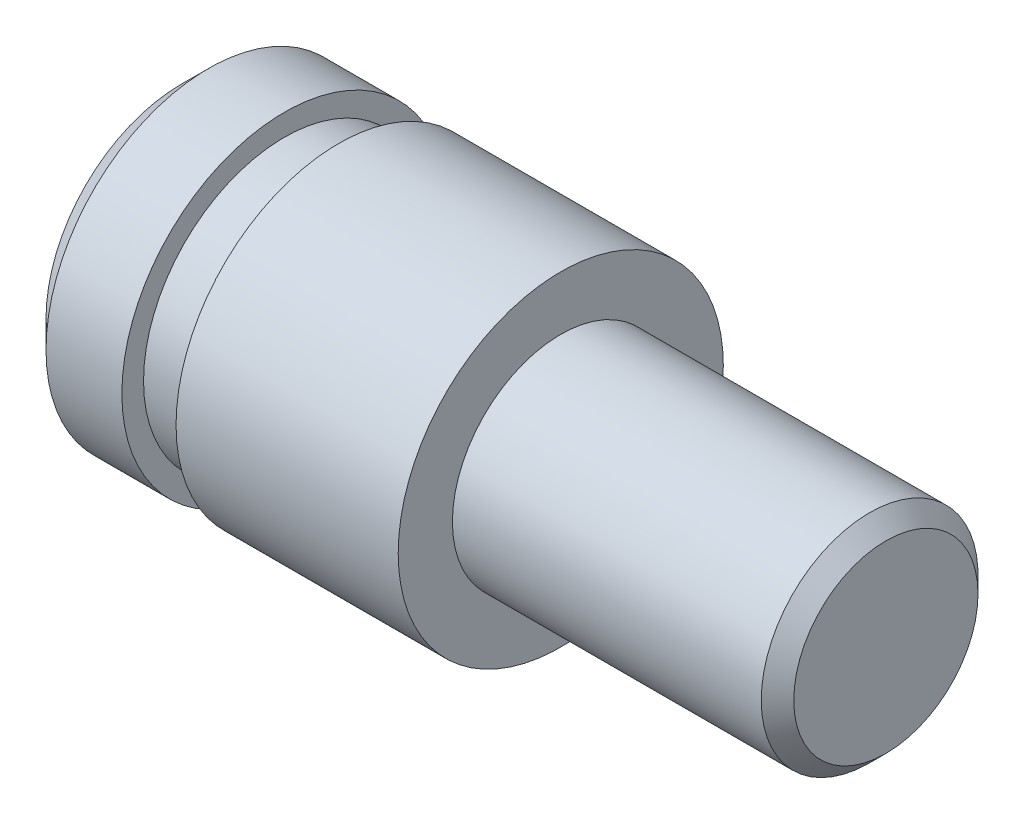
ISO-10303-21;
HEADER;
FILE_DESCRIPTION(('STEP AP214'),'2;1');
FILE_NAME('part.step','',(''),(''),'','','');
FILE_SCHEMA(('AUTOMOTIVE_DESIGN { 1 0 10303 214 1 1 1 1 }'));
ENDSEC;
DATA;
#1=APPLICATION_CONTEXT('core data for automotive mechanical design processes');
#2=APPLICATION_PROTOCOL_DEFINITION('international standard','automotive_design',2000,#1);
#3=PRODUCT_CONTEXT('',#1,'mechanical');
#4=PRODUCT('Part','Part','',(#3));
#5=PRODUCT_RELATED_PRODUCT_CATEGORY('part','',(#4));
#6=PRODUCT_DEFINITION_FORMATION('','',#4);
#7=PRODUCT_DEFINITION_CONTEXT('part definition',#1,'design');
#8=PRODUCT_DEFINITION('design','',#6,#7);
#9=PRODUCT_DEFINITION_SHAPE('','',#8);
#10=(LENGTH_UNIT() NAMED_UNIT(*) SI_UNIT(.MILLI.,.METRE.));
#11=(NAMED_UNIT(*) PLANE_ANGLE_UNIT() SI_UNIT($,.RADIAN.));
#12=(NAMED_UNIT(*) SI_UNIT($,.STERADIAN.) SOLID_ANGLE_UNIT());
#13=UNCERTAINTY_MEASURE_WITH_UNIT(LENGTH_MEASURE(1.E-05),#10,'distance_accuracy_value','');
#14=(GEOMETRIC_REPRESENTATION_CONTEXT(3) GLOBAL_UNCERTAINTY_ASSIGNED_CONTEXT((#13)) GLOBAL_UNIT_ASSIGNED_CONTEXT((#10,
#11,#12)) REPRESENTATION_CONTEXT('',''));
#15=CARTESIAN_POINT('',(0.,0.,0.));
#16=DIRECTION('',(0.,0.,1.));
#17=DIRECTION('',(1.,0.,0.));
#18=AXIS2_PLACEMENT_3D('',#15,#16,#17);
#19=CARTESIAN_POINT('',(0.,1.,0.));
#20=DIRECTION('',(-1.,0.,0.));
#21=DIRECTION('',(0.,0.,1.));
#22=AXIS2_PLACEMENT_3D('',#19,#20,#21);
#23=PLANE('',#22);
#24=CARTESIAN_POINT('',(0.,0.,0.));
#25=DIRECTION('',(-1.,0.,0.));
#26=DIRECTION('',(0.,0.,1.));
#27=AXIS2_PLACEMENT_3D('',#24,#25,#26);
#28=CIRCLE('',#27,1.5);
#29=CARTESIAN_POINT('',(0.,0.,1.5));
#30=VERTEX_POINT('',#29);
#31=EDGE_CURVE('E49',#30,#30,#28,.T.);
#32=ORIENTED_EDGE('',*,*,#31,.F.);
#33=EDGE_LOOP('',(#32));
#34=FACE_BOUND('',#33,.T.);
#35=CARTESIAN_POINT('',(0.,0.,0.));
#36=DIRECTION('',(-1.,0.,0.));
#37=DIRECTION('',(0.,0.,1.));
#38=AXIS2_PLACEMENT_3D('',#35,#36,#37);
#39=CIRCLE('',#38,1.);
#40=CARTESIAN_POINT('',(0.,0.,1.));
#41=VERTEX_POINT('',#40);
#42=EDGE_CURVE('E34',#41,#41,#39,.T.);
#43=ORIENTED_EDGE('',*,*,#42,.T.);
#44=EDGE_LOOP('',(#43));
#45=FACE_BOUND('',#44,.T.);
#46=ADVANCED_FACE('F15',(#34,#45),#23,.F.);
#47=CARTESIAN_POINT('',(0.,0.,0.));
#48=DIRECTION('',(-1.,0.,0.));
#49=DIRECTION('',(0.,0.,1.));
#50=AXIS2_PLACEMENT_3D('',#47,#48,#49);
#51=CYLINDRICAL_SURFACE('',#50,1.);
#52=CARTESIAN_POINT('',(2.85,0.,0.));
#53=DIRECTION('',(-1.,0.,0.));
#54=DIRECTION('',(0.,0.,1.));
#55=AXIS2_PLACEMENT_3D('',#52,#53,#54);
#56=CIRCLE('',#55,1.);
#57=CARTESIAN_POINT('',(2.85,0.,1.));
#58=VERTEX_POINT('',#57);
#59=EDGE_CURVE('E29',#58,#58,#56,.T.);
#60=ORIENTED_EDGE('',*,*,#59,.T.);
#61=EDGE_LOOP('',(#60));
#62=FACE_BOUND('',#61,.T.);
#63=ORIENTED_EDGE('',*,*,#42,.F.);
#64=EDGE_LOOP('',(#63));
#65=FACE_BOUND('',#64,.T.);
#66=ADVANCED_FACE('F57',(#62,#65),#51,.T.);
#67=CARTESIAN_POINT('',(3.,1.,0.));
#68=DIRECTION('',(-1.,0.,0.));
#69=DIRECTION('',(0.,0.,1.));
#70=AXIS2_PLACEMENT_3D('',#67,#68,#69);
#71=PLANE('',#70);
#72=CARTESIAN_POINT('',(3.,0.,0.));
#73=DIRECTION('',(-1.,0.,0.));
#74=DIRECTION('',(0.,0.,1.));
#75=AXIS2_PLACEMENT_3D('',#72,#73,#74);
#76=CIRCLE('',#75,0.85);
#77=CARTESIAN_POINT('',(3.,0.,0.85));
#78=VERTEX_POINT('',#77);
#79=EDGE_CURVE('E25',#78,#78,#76,.F.);
#80=ORIENTED_EDGE('',*,*,#79,.T.);
#81=EDGE_LOOP('',(#80));
#82=FACE_BOUND('',#81,.T.);
#83=ADVANCED_FACE('F61',(#82),#71,.F.);
#84=CARTESIAN_POINT('',(-3.5,1.5,0.));
#85=DIRECTION('',(1.,0.,0.));
#86=DIRECTION('',(0.,0.,-1.));
#87=AXIS2_PLACEMENT_3D('',#84,#85,#86);
#88=PLANE('',#87);
#89=CARTESIAN_POINT('',(-3.5,0.,0.));
#90=DIRECTION('',(1.,0.,0.));
#91=DIRECTION('',(0.,0.,-1.));
#92=AXIS2_PLACEMENT_3D('',#89,#90,#91);
#93=CIRCLE('',#92,1.25);
#94=CARTESIAN_POINT('',(-3.5,0.,-1.25));
#95=VERTEX_POINT('',#94);
#96=EDGE_CURVE('E21',#95,#95,#93,.F.);
#97=ORIENTED_EDGE('',*,*,#96,.T.);
#98=EDGE_LOOP('',(#97));
#99=FACE_BOUND('',#98,.T.);
#100=ADVANCED_FACE('F67',(#99),#88,.F.);
#101=CARTESIAN_POINT('',(0.,0.,0.));
#102=DIRECTION('',(-1.,0.,0.));
#103=DIRECTION('',(0.,0.,1.));
#104=AXIS2_PLACEMENT_3D('',#101,#102,#103);
#105=CYLINDRICAL_SURFACE('',#104,1.5);
#106=CARTESIAN_POINT('',(-3.25,0.,0.));
#107=DIRECTION('',(1.,0.,0.));
#108=DIRECTION('',(0.,0.,-1.));
#109=AXIS2_PLACEMENT_3D('',#106,#107,#108);
#110=CIRCLE('',#109,1.5);
#111=CARTESIAN_POINT('',(-3.25,0.,-1.5));
#112=VERTEX_POINT('',#111);
#113=EDGE_CURVE('E10',#112,#112,#110,.T.);
#114=ORIENTED_EDGE('',*,*,#113,.T.);
#115=EDGE_LOOP('',(#114));
#116=FACE_BOUND('',#115,.T.);
#117=CARTESIAN_POINT('',(-2.55,0.,0.));
#118=DIRECTION('',(-1.,0.,0.));
#119=DIRECTION('',(0.,0.,1.));
#120=AXIS2_PLACEMENT_3D('',#117,#118,#119);
#121=CIRCLE('',#120,1.5);
#122=CARTESIAN_POINT('',(-2.55,0.,1.5));
#123=VERTEX_POINT('',#122);
#124=EDGE_CURVE('E37',#123,#123,#121,.T.);
#125=ORIENTED_EDGE('',*,*,#124,.T.);
#126=EDGE_LOOP('',(#125));
#127=FACE_BOUND('',#126,.T.);
#128=ADVANCED_FACE('F73',(#116,#127),#105,.T.);
#129=CARTESIAN_POINT('',(-2.55,1.5,0.));
#130=DIRECTION('',(-1.,0.,0.));
#131=DIRECTION('',(0.,0.,1.));
#132=AXIS2_PLACEMENT_3D('',#129,#130,#131);
#133=PLANE('',#132);
#134=ORIENTED_EDGE('',*,*,#124,.F.);
#135=EDGE_LOOP('',(#134));
#136=FACE_BOUND('',#135,.T.);
#137=CARTESIAN_POINT('',(-2.55,0.,0.));
#138=DIRECTION('',(-1.,0.,0.));
#139=DIRECTION('',(0.,0.,1.));
#140=AXIS2_PLACEMENT_3D('',#137,#138,#139);
#141=CIRCLE('',#140,1.3);
#142=CARTESIAN_POINT('',(-2.55,0.,1.3));
#143=VERTEX_POINT('',#142);
#144=EDGE_CURVE('E40',#143,#143,#141,.T.);
#145=ORIENTED_EDGE('',*,*,#144,.T.);
#146=EDGE_LOOP('',(#145));
#147=FACE_BOUND('',#146,.T.);
#148=ADVANCED_FACE('F76',(#136,#147),#133,.F.);
#149=CARTESIAN_POINT('',(0.,0.,0.));
#150=DIRECTION('',(-1.,0.,0.));
#151=DIRECTION('',(0.,0.,1.));
#152=AXIS2_PLACEMENT_3D('',#149,#150,#151);
#153=CYLINDRICAL_SURFACE('',#152,1.3);
#154=ORIENTED_EDGE('',*,*,#144,.F.);
#155=EDGE_LOOP('',(#154));
#156=FACE_BOUND('',#155,.T.);
#157=CARTESIAN_POINT('',(-2.05,0.,0.));
#158=DIRECTION('',(-1.,0.,0.));
#159=DIRECTION('',(0.,0.,1.));
#160=AXIS2_PLACEMENT_3D('',#157,#158,#159);
#161=CIRCLE('',#160,1.3);
#162=CARTESIAN_POINT('',(-2.05,0.,1.3));
#163=VERTEX_POINT('',#162);
#164=EDGE_CURVE('E43',#163,#163,#161,.T.);
#165=ORIENTED_EDGE('',*,*,#164,.T.);
#166=EDGE_LOOP('',(#165));
#167=FACE_BOUND('',#166,.T.);
#168=ADVANCED_FACE('F79',(#156,#167),#153,.T.);
#169=CARTESIAN_POINT('',(-2.05,1.5,0.));
#170=DIRECTION('',(1.,0.,0.));
#171=DIRECTION('',(0.,0.,-1.));
#172=AXIS2_PLACEMENT_3D('',#169,#170,#171);
#173=PLANE('',#172);
#174=ORIENTED_EDGE('',*,*,#164,.F.);
#175=EDGE_LOOP('',(#174));
#176=FACE_BOUND('',#175,.T.);
#177=CARTESIAN_POINT('',(-2.05,0.,0.));
#178=DIRECTION('',(-1.,0.,0.));
#179=DIRECTION('',(0.,0.,1.));
#180=AXIS2_PLACEMENT_3D('',#177,#178,#179);
#181=CIRCLE('',#180,1.5);
#182=CARTESIAN_POINT('',(-2.05,0.,1.5));
#183=VERTEX_POINT('',#182);
#184=EDGE_CURVE('E46',#183,#183,#181,.T.);
#185=ORIENTED_EDGE('',*,*,#184,.T.);
#186=EDGE_LOOP('',(#185));
#187=FACE_BOUND('',#186,.T.);
#188=ADVANCED_FACE('F83',(#176,#187),#173,.F.);
#189=CARTESIAN_POINT('',(0.,0.,0.));
#190=DIRECTION('',(-1.,0.,0.));
#191=DIRECTION('',(0.,0.,1.));
#192=AXIS2_PLACEMENT_3D('',#189,#190,#191);
#193=CYLINDRICAL_SURFACE('',#192,1.5);
#194=ORIENTED_EDGE('',*,*,#184,.F.);
#195=EDGE_LOOP('',(#194));
#196=FACE_BOUND('',#195,.T.);
#197=ORIENTED_EDGE('',*,*,#31,.T.);
#198=EDGE_LOOP('',(#197));
#199=FACE_BOUND('',#198,.T.);
#200=ADVANCED_FACE('F53',(#196,#199),#193,.T.);
#201=CARTESIAN_POINT('',(2.85,0.,0.));
#202=DIRECTION('',(-1.,0.,0.));
#203=DIRECTION('',(0.,0.,1.));
#204=AXIS2_PLACEMENT_3D('',#201,#202,#203);
#205=CONICAL_SURFACE('',#204,1.,0.78539816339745);
#206=ORIENTED_EDGE('',*,*,#79,.F.);
#207=EDGE_LOOP('',(#206));
#208=FACE_BOUND('',#207,.T.);
#209=ORIENTED_EDGE('',*,*,#59,.F.);
#210=EDGE_LOOP('',(#209));
#211=FACE_BOUND('',#210,.T.);
#212=ADVANCED_FACE('F90',(#208,#211),#205,.T.);
#213=CARTESIAN_POINT('',(-3.5,0.,0.));
#214=DIRECTION('',(1.,0.,0.));
#215=DIRECTION('',(0.,0.,-1.));
#216=AXIS2_PLACEMENT_3D('',#213,#214,#215);
#217=CONICAL_SURFACE('',#216,1.25,0.785398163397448);
#218=ORIENTED_EDGE('',*,*,#113,.F.);
#219=EDGE_LOOP('',(#218));
#220=FACE_BOUND('',#219,.T.);
#221=ORIENTED_EDGE('',*,*,#96,.F.);
#222=EDGE_LOOP('',(#221));
#223=FACE_BOUND('',#222,.T.);
#224=ADVANCED_FACE('F94',(#220,#223),#217,.T.);
#225=CLOSED_SHELL('',(#46,#66,#83,#100,#128,#148,#168,#188,#200,#212,#224));
#226=MANIFOLD_SOLID_BREP('B1',#225);
#227=ADVANCED_BREP_SHAPE_REPRESENTATION('',(#18,#226),#14);
#228=SHAPE_DEFINITION_REPRESENTATION(#9,#227);
ENDSEC;
END-ISO-10303-21;
